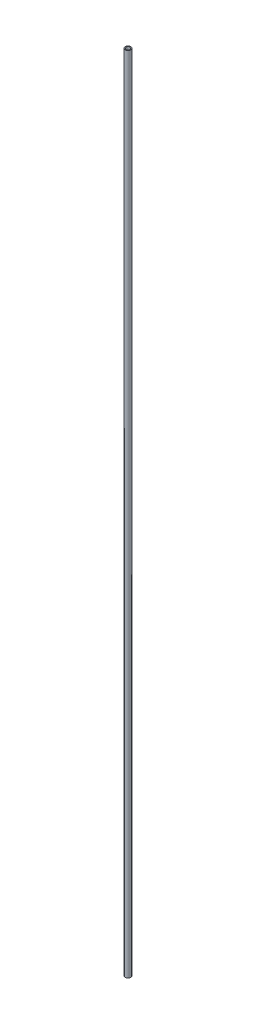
from build123d import *

# Parameters (mm, degrees)
SKETCH1_R           = 10.668
SKETCH1_R_2         = 7.6454
BOSS_EXTRUDE1_DEPTH = 3048


with BuildPart() as part:
    # Sketch1 → Boss-Extrude1 (new body)
    with BuildSketch(Plane(origin=(0, 0, 0), x_dir=(1, 0, 0), z_dir=(0, 1, 0))):
        with Locations(Location((0, 0, 0), (0, 0, 270))):
            Circle(SKETCH1_R)
        with Locations(Location((0, 0, 0), (0, 0, 270))):
            Circle(SKETCH1_R_2, mode=Mode.SUBTRACT)
    extrude(amount=BOSS_EXTRUDE1_DEPTH)


solid = part.part
